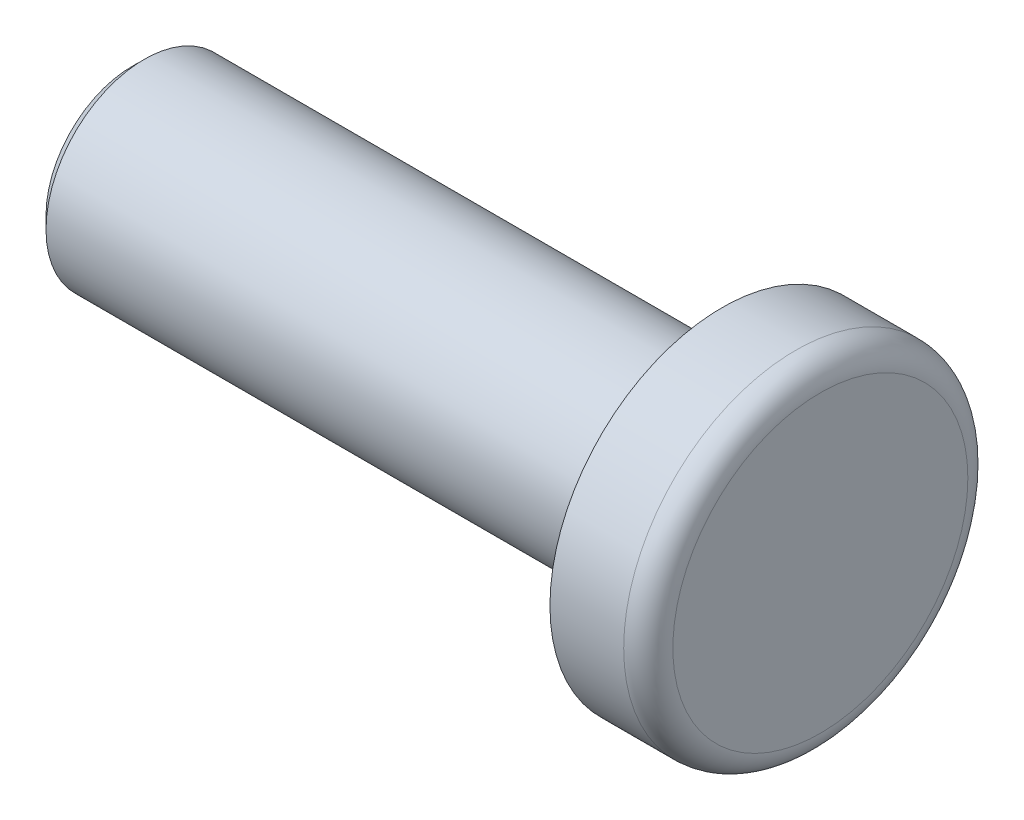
from build123d import *

# Parameters (mm, degrees)
SKETCH_1_R      = 3.5
EXTRUDE_1_DEPTH = 2
SKETCH_2_R      = 2
EXTRUDE_2_DEPTH = 12
CHAMFER_1_SIZE  = 0.25
FILLET_1_R      = 0.5


with BuildPart() as part:
    # Sketch 1 → Extrude 1 (new body)
    with BuildSketch(Plane(origin=(0, 0, 0), x_dir=(0, 0, -1), z_dir=(1, 0, 0))):
        Circle(SKETCH_1_R)
    extrude(amount=EXTRUDE_1_DEPTH)

    # Sketch 2 → Extrude 2 (add)
    with BuildSketch(Plane.ZY):
        with Locations(Location((0, 0, 0), (0, 0, 180))):
            Circle(SKETCH_2_R)
    extrude(amount=EXTRUDE_2_DEPTH)

    # Chamfer 1
    chamfer_1_edges = [part.edges().sort_by_distance(p)[0] for p in [
        (-12, 0, 2),
    ]]
    chamfer(chamfer_1_edges, length=CHAMFER_1_SIZE)

    # Fillet 1
    fillet_1_edges = [part.edges().sort_by_distance(p)[0] for p in [
        (2, 0, 3.5),
    ]]
    fillet(fillet_1_edges, radius=FILLET_1_R)


solid = part.part
